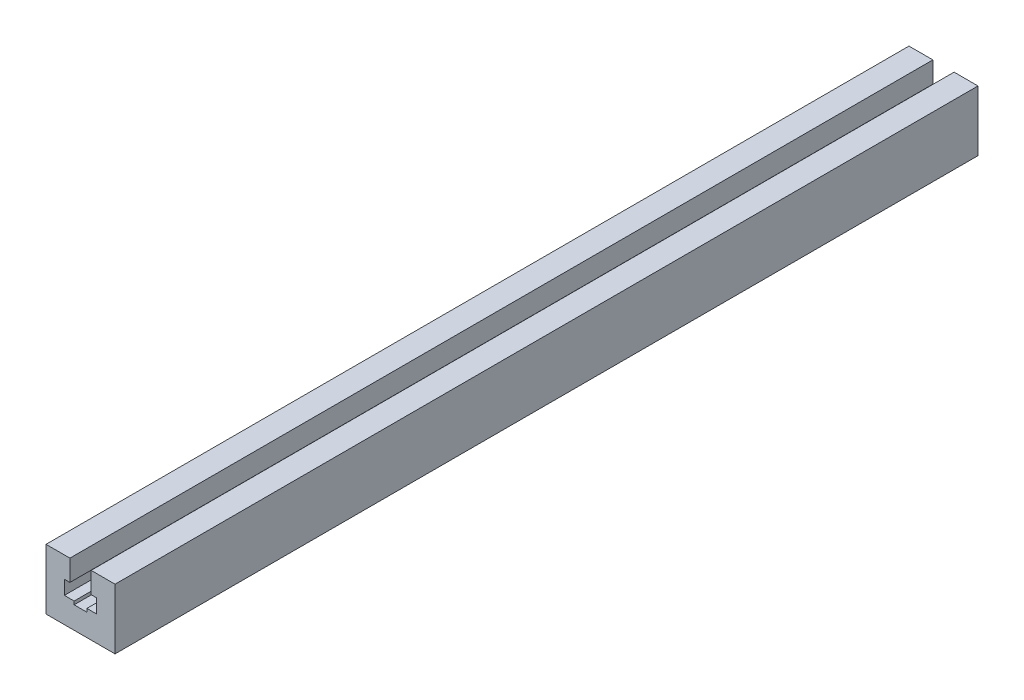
ISO-10303-21;
HEADER;
FILE_DESCRIPTION(('STEP AP214'),'2;1');
FILE_NAME('part.step','',(''),(''),'','','');
FILE_SCHEMA(('AUTOMOTIVE_DESIGN { 1 0 10303 214 1 1 1 1 }'));
ENDSEC;
DATA;
#1=APPLICATION_CONTEXT('core data for automotive mechanical design processes');
#2=APPLICATION_PROTOCOL_DEFINITION('international standard','automotive_design',2000,#1);
#3=PRODUCT_CONTEXT('',#1,'mechanical');
#4=PRODUCT('Part','Part','',(#3));
#5=PRODUCT_RELATED_PRODUCT_CATEGORY('part','',(#4));
#6=PRODUCT_DEFINITION_FORMATION('','',#4);
#7=PRODUCT_DEFINITION_CONTEXT('part definition',#1,'design');
#8=PRODUCT_DEFINITION('design','',#6,#7);
#9=PRODUCT_DEFINITION_SHAPE('','',#8);
#10=(LENGTH_UNIT() NAMED_UNIT(*) SI_UNIT(.MILLI.,.METRE.));
#11=(NAMED_UNIT(*) PLANE_ANGLE_UNIT() SI_UNIT($,.RADIAN.));
#12=(NAMED_UNIT(*) SI_UNIT($,.STERADIAN.) SOLID_ANGLE_UNIT());
#13=UNCERTAINTY_MEASURE_WITH_UNIT(LENGTH_MEASURE(1.E-05),#10,'distance_accuracy_value','');
#14=(GEOMETRIC_REPRESENTATION_CONTEXT(3) GLOBAL_UNCERTAINTY_ASSIGNED_CONTEXT((#13)) GLOBAL_UNIT_ASSIGNED_CONTEXT((#10,
#11,#12)) REPRESENTATION_CONTEXT('',''));
#15=CARTESIAN_POINT('',(0.,0.,0.));
#16=DIRECTION('',(0.,0.,1.));
#17=DIRECTION('',(1.,0.,0.));
#18=AXIS2_PLACEMENT_3D('',#15,#16,#17);
#19=CARTESIAN_POINT('',(-9.35000000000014,14.7,0.));
#20=DIRECTION('',(0.,-1.,0.));
#21=DIRECTION('',(0.,0.,-1.));
#22=AXIS2_PLACEMENT_3D('',#19,#20,#21);
#23=PLANE('',#22);
#24=DIRECTION('',(1.,0.,0.));
#25=VECTOR('',#24,1.);
#26=CARTESIAN_POINT('',(-9.35000000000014,14.7,500.));
#27=LINE('',#26,#25);
#28=CARTESIAN_POINT('',(-9.35000000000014,14.7,500.));
#29=VERTEX_POINT('',#28);
#30=CARTESIAN_POINT('',(-3.7,14.7,500.));
#31=VERTEX_POINT('',#30);
#32=EDGE_CURVE('E183',#29,#31,#27,.T.);
#33=ORIENTED_EDGE('',*,*,#32,.T.);
#34=DIRECTION('',(0.,0.,1.));
#35=VECTOR('',#34,1.);
#36=CARTESIAN_POINT('',(-3.7,14.7,0.));
#37=LINE('',#36,#35);
#38=CARTESIAN_POINT('',(-3.7,14.7,0.));
#39=VERTEX_POINT('',#38);
#40=EDGE_CURVE('E155',#39,#31,#37,.T.);
#41=ORIENTED_EDGE('',*,*,#40,.F.);
#42=DIRECTION('',(1.,0.,0.));
#43=VECTOR('',#42,1.);
#44=CARTESIAN_POINT('',(-9.35000000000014,14.7,0.));
#45=LINE('',#44,#43);
#46=CARTESIAN_POINT('',(-9.35000000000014,14.7,0.));
#47=VERTEX_POINT('',#46);
#48=EDGE_CURVE('E146',#47,#39,#45,.T.);
#49=ORIENTED_EDGE('',*,*,#48,.F.);
#50=DIRECTION('',(0.,0.,1.));
#51=VECTOR('',#50,1.);
#52=CARTESIAN_POINT('',(-9.35000000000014,14.7,0.));
#53=LINE('',#52,#51);
#54=EDGE_CURVE('E246',#47,#29,#53,.T.);
#55=ORIENTED_EDGE('',*,*,#54,.T.);
#56=EDGE_LOOP('',(#33,#41,#49,#55));
#57=FACE_BOUND('',#56,.T.);
#58=ADVANCED_FACE('F14',(#57),#23,.F.);
#59=CARTESIAN_POINT('',(-20.,35.,0.));
#60=DIRECTION('',(-1.,0.,0.));
#61=DIRECTION('',(0.,0.,1.));
#62=AXIS2_PLACEMENT_3D('',#59,#60,#61);
#63=PLANE('',#62);
#64=DIRECTION('',(0.,0.,1.));
#65=VECTOR('',#64,1.);
#66=CARTESIAN_POINT('',(-20.,35.,0.));
#67=LINE('',#66,#65);
#68=CARTESIAN_POINT('',(-20.,35.,0.));
#69=VERTEX_POINT('',#68);
#70=CARTESIAN_POINT('',(-20.,35.,500.));
#71=VERTEX_POINT('',#70);
#72=EDGE_CURVE('E9',#69,#71,#67,.T.);
#73=ORIENTED_EDGE('',*,*,#72,.F.);
#74=DIRECTION('',(0.,-1.,0.));
#75=VECTOR('',#74,1.);
#76=CARTESIAN_POINT('',(-20.,35.,0.));
#77=LINE('',#76,#75);
#78=CARTESIAN_POINT('',(-20.,0.,0.));
#79=VERTEX_POINT('',#78);
#80=EDGE_CURVE('E198',#69,#79,#77,.T.);
#81=ORIENTED_EDGE('',*,*,#80,.T.);
#82=DIRECTION('',(0.,0.,1.));
#83=VECTOR('',#82,1.);
#84=CARTESIAN_POINT('',(-20.,0.,0.));
#85=LINE('',#84,#83);
#86=CARTESIAN_POINT('',(-20.,0.,500.));
#87=VERTEX_POINT('',#86);
#88=EDGE_CURVE('E231',#79,#87,#85,.T.);
#89=ORIENTED_EDGE('',*,*,#88,.T.);
#90=DIRECTION('',(0.,-1.,0.));
#91=VECTOR('',#90,1.);
#92=CARTESIAN_POINT('',(-20.,35.,500.));
#93=LINE('',#92,#91);
#94=EDGE_CURVE('E157',#71,#87,#93,.T.);
#95=ORIENTED_EDGE('',*,*,#94,.F.);
#96=EDGE_LOOP('',(#73,#81,#89,#95));
#97=FACE_BOUND('',#96,.T.);
#98=ADVANCED_FACE('F262',(#97),#63,.T.);
#99=CARTESIAN_POINT('',(-20.,35.,0.));
#100=DIRECTION('',(0.,-1.,0.));
#101=DIRECTION('',(1.,0.,0.));
#102=AXIS2_PLACEMENT_3D('',#99,#100,#101);
#103=PLANE('',#102);
#104=DIRECTION('',(0.,0.,1.));
#105=VECTOR('',#104,1.);
#106=CARTESIAN_POINT('',(-6.15,35.,0.));
#107=LINE('',#106,#105);
#108=CARTESIAN_POINT('',(-6.15,35.,0.));
#109=VERTEX_POINT('',#108);
#110=CARTESIAN_POINT('',(-6.15,35.,500.));
#111=VERTEX_POINT('',#110);
#112=EDGE_CURVE('E22',#109,#111,#107,.T.);
#113=ORIENTED_EDGE('',*,*,#112,.F.);
#114=DIRECTION('',(1.,0.,0.));
#115=VECTOR('',#114,1.);
#116=CARTESIAN_POINT('',(-20.,35.,0.));
#117=LINE('',#116,#115);
#118=EDGE_CURVE('E228',#69,#109,#117,.T.);
#119=ORIENTED_EDGE('',*,*,#118,.F.);
#120=ORIENTED_EDGE('',*,*,#72,.T.);
#121=DIRECTION('',(1.,0.,0.));
#122=VECTOR('',#121,1.);
#123=CARTESIAN_POINT('',(-20.,35.,500.));
#124=LINE('',#123,#122);
#125=EDGE_CURVE('E195',#71,#111,#124,.T.);
#126=ORIENTED_EDGE('',*,*,#125,.T.);
#127=EDGE_LOOP('',(#113,#119,#120,#126));
#128=FACE_BOUND('',#127,.T.);
#129=ADVANCED_FACE('F16',(#128),#103,.F.);
#130=CARTESIAN_POINT('',(-6.15,22.8,0.));
#131=DIRECTION('',(1.,0.,0.));
#132=DIRECTION('',(0.,0.,-1.));
#133=AXIS2_PLACEMENT_3D('',#130,#131,#132);
#134=PLANE('',#133);
#135=DIRECTION('',(0.,0.,1.));
#136=VECTOR('',#135,1.);
#137=CARTESIAN_POINT('',(-6.15,22.8,0.));
#138=LINE('',#137,#136);
#139=CARTESIAN_POINT('',(-6.15,22.8,0.));
#140=VERTEX_POINT('',#139);
#141=CARTESIAN_POINT('',(-6.15,22.8,500.));
#142=VERTEX_POINT('',#141);
#143=EDGE_CURVE('E250',#140,#142,#138,.T.);
#144=ORIENTED_EDGE('',*,*,#143,.F.);
#145=DIRECTION('',(0.,1.,0.));
#146=VECTOR('',#145,1.);
#147=CARTESIAN_POINT('',(-6.15,22.8,0.));
#148=LINE('',#147,#146);
#149=EDGE_CURVE('E225',#140,#109,#148,.T.);
#150=ORIENTED_EDGE('',*,*,#149,.T.);
#151=ORIENTED_EDGE('',*,*,#112,.T.);
#152=DIRECTION('',(0.,1.,0.));
#153=VECTOR('',#152,1.);
#154=CARTESIAN_POINT('',(-6.15,22.8,500.));
#155=LINE('',#154,#153);
#156=EDGE_CURVE('E192',#142,#111,#155,.T.);
#157=ORIENTED_EDGE('',*,*,#156,.F.);
#158=EDGE_LOOP('',(#144,#150,#151,#157));
#159=FACE_BOUND('',#158,.T.);
#160=ADVANCED_FACE('F253',(#159),#134,.T.);
#161=CARTESIAN_POINT('',(-9.35,22.8,0.));
#162=DIRECTION('',(0.,-1.,0.));
#163=DIRECTION('',(0.,0.,-1.));
#164=AXIS2_PLACEMENT_3D('',#161,#162,#163);
#165=PLANE('',#164);
#166=DIRECTION('',(0.,0.,1.));
#167=VECTOR('',#166,1.);
#168=CARTESIAN_POINT('',(-9.35,22.8,0.));
#169=LINE('',#168,#167);
#170=CARTESIAN_POINT('',(-9.35,22.8,0.));
#171=VERTEX_POINT('',#170);
#172=CARTESIAN_POINT('',(-9.35,22.8,500.));
#173=VERTEX_POINT('',#172);
#174=EDGE_CURVE('E248',#171,#173,#169,.T.);
#175=ORIENTED_EDGE('',*,*,#174,.F.);
#176=DIRECTION('',(1.,0.,0.));
#177=VECTOR('',#176,1.);
#178=CARTESIAN_POINT('',(-9.35,22.8,0.));
#179=LINE('',#178,#177);
#180=EDGE_CURVE('E222',#171,#140,#179,.T.);
#181=ORIENTED_EDGE('',*,*,#180,.T.);
#182=ORIENTED_EDGE('',*,*,#143,.T.);
#183=DIRECTION('',(1.,0.,0.));
#184=VECTOR('',#183,1.);
#185=CARTESIAN_POINT('',(-9.35,22.8,500.));
#186=LINE('',#185,#184);
#187=EDGE_CURVE('E189',#173,#142,#186,.T.);
#188=ORIENTED_EDGE('',*,*,#187,.F.);
#189=EDGE_LOOP('',(#175,#181,#182,#188));
#190=FACE_BOUND('',#189,.T.);
#191=ADVANCED_FACE('F298',(#190),#165,.T.);
#192=CARTESIAN_POINT('',(-9.35,22.8,0.));
#193=DIRECTION('',(-1.,0.,0.));
#194=DIRECTION('',(0.,-1.,0.));
#195=AXIS2_PLACEMENT_3D('',#192,#193,#194);
#196=PLANE('',#195);
#197=ORIENTED_EDGE('',*,*,#54,.F.);
#198=DIRECTION('',(0.,-1.,0.));
#199=VECTOR('',#198,1.);
#200=CARTESIAN_POINT('',(-9.35,22.8,0.));
#201=LINE('',#200,#199);
#202=EDGE_CURVE('E220',#171,#47,#201,.T.);
#203=ORIENTED_EDGE('',*,*,#202,.F.);
#204=ORIENTED_EDGE('',*,*,#174,.T.);
#205=DIRECTION('',(0.,-1.,0.));
#206=VECTOR('',#205,1.);
#207=CARTESIAN_POINT('',(-9.35,22.8,500.));
#208=LINE('',#207,#206);
#209=EDGE_CURVE('E186',#173,#29,#208,.T.);
#210=ORIENTED_EDGE('',*,*,#209,.T.);
#211=EDGE_LOOP('',(#197,#203,#204,#210));
#212=FACE_BOUND('',#211,.T.);
#213=ADVANCED_FACE('F300',(#212),#196,.F.);
#214=CARTESIAN_POINT('',(3.7,14.7,0.));
#215=VERTEX_POINT('',#214);
#216=CARTESIAN_POINT('',(9.35,14.7,0.));
#217=VERTEX_POINT('',#216);
#218=EDGE_CURVE('E218',#215,#217,#45,.T.);
#219=ORIENTED_EDGE('',*,*,#218,.F.);
#220=DIRECTION('',(0.,0.,1.));
#221=VECTOR('',#220,1.);
#222=CARTESIAN_POINT('',(3.7,14.7,0.));
#223=LINE('',#222,#221);
#224=CARTESIAN_POINT('',(3.7,14.7,500.));
#225=VERTEX_POINT('',#224);
#226=EDGE_CURVE('E158',#215,#225,#223,.T.);
#227=ORIENTED_EDGE('',*,*,#226,.T.);
#228=CARTESIAN_POINT('',(9.35,14.7,500.));
#229=VERTEX_POINT('',#228);
#230=EDGE_CURVE('E182',#225,#229,#27,.T.);
#231=ORIENTED_EDGE('',*,*,#230,.T.);
#232=DIRECTION('',(0.,0.,1.));
#233=VECTOR('',#232,1.);
#234=CARTESIAN_POINT('',(9.35,14.7,0.));
#235=LINE('',#234,#233);
#236=EDGE_CURVE('E243',#217,#229,#235,.T.);
#237=ORIENTED_EDGE('',*,*,#236,.F.);
#238=EDGE_LOOP('',(#219,#227,#231,#237));
#239=FACE_BOUND('',#238,.T.);
#240=ADVANCED_FACE('F292',(#239),#23,.F.);
#241=CARTESIAN_POINT('',(9.35,22.8,0.));
#242=DIRECTION('',(-1.,0.,0.));
#243=DIRECTION('',(0.,0.,1.));
#244=AXIS2_PLACEMENT_3D('',#241,#242,#243);
#245=PLANE('',#244);
#246=DIRECTION('',(0.,0.,1.));
#247=VECTOR('',#246,1.);
#248=CARTESIAN_POINT('',(9.35,22.8,0.));
#249=LINE('',#248,#247);
#250=CARTESIAN_POINT('',(9.35,22.8,0.));
#251=VERTEX_POINT('',#250);
#252=CARTESIAN_POINT('',(9.35,22.8,500.));
#253=VERTEX_POINT('',#252);
#254=EDGE_CURVE('E241',#251,#253,#249,.T.);
#255=ORIENTED_EDGE('',*,*,#254,.F.);
#256=DIRECTION('',(0.,-1.,0.));
#257=VECTOR('',#256,1.);
#258=CARTESIAN_POINT('',(9.35,22.8,0.));
#259=LINE('',#258,#257);
#260=EDGE_CURVE('E215',#251,#217,#259,.T.);
#261=ORIENTED_EDGE('',*,*,#260,.T.);
#262=ORIENTED_EDGE('',*,*,#236,.T.);
#263=DIRECTION('',(0.,-1.,0.));
#264=VECTOR('',#263,1.);
#265=CARTESIAN_POINT('',(9.35,22.8,500.));
#266=LINE('',#265,#264);
#267=EDGE_CURVE('E179',#253,#229,#266,.T.);
#268=ORIENTED_EDGE('',*,*,#267,.F.);
#269=EDGE_LOOP('',(#255,#261,#262,#268));
#270=FACE_BOUND('',#269,.T.);
#271=ADVANCED_FACE('F286',(#270),#245,.T.);
#272=CARTESIAN_POINT('',(6.15,22.8,0.));
#273=DIRECTION('',(0.,-1.,0.));
#274=DIRECTION('',(0.,0.,-1.));
#275=AXIS2_PLACEMENT_3D('',#272,#273,#274);
#276=PLANE('',#275);
#277=DIRECTION('',(0.,0.,1.));
#278=VECTOR('',#277,1.);
#279=CARTESIAN_POINT('',(6.15,22.8,0.));
#280=LINE('',#279,#278);
#281=CARTESIAN_POINT('',(6.15,22.8,0.));
#282=VERTEX_POINT('',#281);
#283=CARTESIAN_POINT('',(6.15,22.8,500.));
#284=VERTEX_POINT('',#283);
#285=EDGE_CURVE('E239',#282,#284,#280,.T.);
#286=ORIENTED_EDGE('',*,*,#285,.F.);
#287=DIRECTION('',(1.,0.,0.));
#288=VECTOR('',#287,1.);
#289=CARTESIAN_POINT('',(6.15,22.8,0.));
#290=LINE('',#289,#288);
#291=EDGE_CURVE('E212',#282,#251,#290,.T.);
#292=ORIENTED_EDGE('',*,*,#291,.T.);
#293=ORIENTED_EDGE('',*,*,#254,.T.);
#294=DIRECTION('',(1.,0.,0.));
#295=VECTOR('',#294,1.);
#296=CARTESIAN_POINT('',(6.15,22.8,500.));
#297=LINE('',#296,#295);
#298=EDGE_CURVE('E176',#284,#253,#297,.T.);
#299=ORIENTED_EDGE('',*,*,#298,.F.);
#300=EDGE_LOOP('',(#286,#292,#293,#299));
#301=FACE_BOUND('',#300,.T.);
#302=ADVANCED_FACE('F283',(#301),#276,.T.);
#303=CARTESIAN_POINT('',(6.15,22.8,0.));
#304=DIRECTION('',(1.,0.,0.));
#305=DIRECTION('',(0.,0.,-1.));
#306=AXIS2_PLACEMENT_3D('',#303,#304,#305);
#307=PLANE('',#306);
#308=DIRECTION('',(0.,0.,1.));
#309=VECTOR('',#308,1.);
#310=CARTESIAN_POINT('',(6.15,35.,0.));
#311=LINE('',#310,#309);
#312=CARTESIAN_POINT('',(6.15,35.,0.));
#313=VERTEX_POINT('',#312);
#314=CARTESIAN_POINT('',(6.15,35.,500.));
#315=VERTEX_POINT('',#314);
#316=EDGE_CURVE('E237',#313,#315,#311,.T.);
#317=ORIENTED_EDGE('',*,*,#316,.F.);
#318=DIRECTION('',(0.,1.,0.));
#319=VECTOR('',#318,1.);
#320=CARTESIAN_POINT('',(6.15,22.8,0.));
#321=LINE('',#320,#319);
#322=EDGE_CURVE('E209',#282,#313,#321,.T.);
#323=ORIENTED_EDGE('',*,*,#322,.F.);
#324=ORIENTED_EDGE('',*,*,#285,.T.);
#325=DIRECTION('',(0.,1.,0.));
#326=VECTOR('',#325,1.);
#327=CARTESIAN_POINT('',(6.15,22.8,500.));
#328=LINE('',#327,#326);
#329=EDGE_CURVE('E173',#284,#315,#328,.T.);
#330=ORIENTED_EDGE('',*,*,#329,.T.);
#331=EDGE_LOOP('',(#317,#323,#324,#330));
#332=FACE_BOUND('',#331,.T.);
#333=ADVANCED_FACE('F278',(#332),#307,.F.);
#334=CARTESIAN_POINT('',(6.15,35.,0.));
#335=DIRECTION('',(0.,-1.,0.));
#336=DIRECTION('',(1.,0.,0.));
#337=AXIS2_PLACEMENT_3D('',#334,#335,#336);
#338=PLANE('',#337);
#339=DIRECTION('',(0.,0.,1.));
#340=VECTOR('',#339,1.);
#341=CARTESIAN_POINT('',(20.,35.,0.));
#342=LINE('',#341,#340);
#343=CARTESIAN_POINT('',(20.,35.,0.));
#344=VERTEX_POINT('',#343);
#345=CARTESIAN_POINT('',(20.,35.,500.));
#346=VERTEX_POINT('',#345);
#347=EDGE_CURVE('E235',#344,#346,#342,.T.);
#348=ORIENTED_EDGE('',*,*,#347,.F.);
#349=DIRECTION('',(1.,0.,0.));
#350=VECTOR('',#349,1.);
#351=CARTESIAN_POINT('',(6.15,35.,0.));
#352=LINE('',#351,#350);
#353=EDGE_CURVE('E206',#313,#344,#352,.T.);
#354=ORIENTED_EDGE('',*,*,#353,.F.);
#355=ORIENTED_EDGE('',*,*,#316,.T.);
#356=DIRECTION('',(1.,0.,0.));
#357=VECTOR('',#356,1.);
#358=CARTESIAN_POINT('',(6.15,35.,500.));
#359=LINE('',#358,#357);
#360=EDGE_CURVE('E170',#315,#346,#359,.T.);
#361=ORIENTED_EDGE('',*,*,#360,.T.);
#362=EDGE_LOOP('',(#348,#354,#355,#361));
#363=FACE_BOUND('',#362,.T.);
#364=ADVANCED_FACE('F274',(#363),#338,.F.);
#365=CARTESIAN_POINT('',(20.,35.,0.));
#366=DIRECTION('',(-1.,0.,0.));
#367=DIRECTION('',(0.,0.,1.));
#368=AXIS2_PLACEMENT_3D('',#365,#366,#367);
#369=PLANE('',#368);
#370=DIRECTION('',(0.,0.,1.));
#371=VECTOR('',#370,1.);
#372=CARTESIAN_POINT('',(20.,0.,0.));
#373=LINE('',#372,#371);
#374=CARTESIAN_POINT('',(20.,0.,0.));
#375=VERTEX_POINT('',#374);
#376=CARTESIAN_POINT('',(20.,0.,500.));
#377=VERTEX_POINT('',#376);
#378=EDGE_CURVE('E233',#375,#377,#373,.T.);
#379=ORIENTED_EDGE('',*,*,#378,.F.);
#380=DIRECTION('',(0.,-1.,0.));
#381=VECTOR('',#380,1.);
#382=CARTESIAN_POINT('',(20.,35.,0.));
#383=LINE('',#382,#381);
#384=EDGE_CURVE('E203',#344,#375,#383,.T.);
#385=ORIENTED_EDGE('',*,*,#384,.F.);
#386=ORIENTED_EDGE('',*,*,#347,.T.);
#387=DIRECTION('',(0.,-1.,0.));
#388=VECTOR('',#387,1.);
#389=CARTESIAN_POINT('',(20.,35.,500.));
#390=LINE('',#389,#388);
#391=EDGE_CURVE('E167',#346,#377,#390,.T.);
#392=ORIENTED_EDGE('',*,*,#391,.T.);
#393=EDGE_LOOP('',(#379,#385,#386,#392));
#394=FACE_BOUND('',#393,.T.);
#395=ADVANCED_FACE('F270',(#394),#369,.F.);
#396=CARTESIAN_POINT('',(-20.,0.,0.));
#397=DIRECTION('',(0.,-1.,0.));
#398=DIRECTION('',(0.,0.,-1.));
#399=AXIS2_PLACEMENT_3D('',#396,#397,#398);
#400=PLANE('',#399);
#401=DIRECTION('',(1.,0.,0.));
#402=VECTOR('',#401,1.);
#403=CARTESIAN_POINT('',(-20.,0.,0.));
#404=LINE('',#403,#402);
#405=EDGE_CURVE('E200',#79,#375,#404,.T.);
#406=ORIENTED_EDGE('',*,*,#405,.T.);
#407=ORIENTED_EDGE('',*,*,#378,.T.);
#408=DIRECTION('',(1.,0.,0.));
#409=VECTOR('',#408,1.);
#410=CARTESIAN_POINT('',(-20.,0.,500.));
#411=LINE('',#410,#409);
#412=EDGE_CURVE('E164',#87,#377,#411,.T.);
#413=ORIENTED_EDGE('',*,*,#412,.F.);
#414=ORIENTED_EDGE('',*,*,#88,.F.);
#415=EDGE_LOOP('',(#406,#407,#413,#414));
#416=FACE_BOUND('',#415,.T.);
#417=ADVANCED_FACE('F266',(#416),#400,.T.);
#418=CARTESIAN_POINT('',(-20.,0.,0.));
#419=DIRECTION('',(0.,0.,1.));
#420=DIRECTION('',(1.,0.,0.));
#421=AXIS2_PLACEMENT_3D('',#418,#419,#420);
#422=PLANE('',#421);
#423=ORIENTED_EDGE('',*,*,#48,.T.);
#424=DIRECTION('',(0.,-1.,0.));
#425=VECTOR('',#424,1.);
#426=CARTESIAN_POINT('',(-3.7,14.7,0.));
#427=LINE('',#426,#425);
#428=CARTESIAN_POINT('',(-3.7,12.8,0.));
#429=VERTEX_POINT('',#428);
#430=EDGE_CURVE('E127',#39,#429,#427,.T.);
#431=ORIENTED_EDGE('',*,*,#430,.T.);
#432=DIRECTION('',(1.,0.,0.));
#433=VECTOR('',#432,1.);
#434=CARTESIAN_POINT('',(-3.7,12.8,0.));
#435=LINE('',#434,#433);
#436=CARTESIAN_POINT('',(3.7,12.8,0.));
#437=VERTEX_POINT('',#436);
#438=EDGE_CURVE('E136',#429,#437,#435,.T.);
#439=ORIENTED_EDGE('',*,*,#438,.T.);
#440=DIRECTION('',(0.,1.,0.));
#441=VECTOR('',#440,1.);
#442=CARTESIAN_POINT('',(3.7,14.7,0.));
#443=LINE('',#442,#441);
#444=EDGE_CURVE('E133',#437,#215,#443,.T.);
#445=ORIENTED_EDGE('',*,*,#444,.T.);
#446=ORIENTED_EDGE('',*,*,#218,.T.);
#447=ORIENTED_EDGE('',*,*,#260,.F.);
#448=ORIENTED_EDGE('',*,*,#291,.F.);
#449=ORIENTED_EDGE('',*,*,#322,.T.);
#450=ORIENTED_EDGE('',*,*,#353,.T.);
#451=ORIENTED_EDGE('',*,*,#384,.T.);
#452=ORIENTED_EDGE('',*,*,#405,.F.);
#453=ORIENTED_EDGE('',*,*,#80,.F.);
#454=ORIENTED_EDGE('',*,*,#118,.T.);
#455=ORIENTED_EDGE('',*,*,#149,.F.);
#456=ORIENTED_EDGE('',*,*,#180,.F.);
#457=ORIENTED_EDGE('',*,*,#202,.T.);
#458=EDGE_LOOP('',(#423,#431,#439,#445,#446,#447,#448,#449,#450,#451,#452,#453,#454,#455,#456,#457));
#459=FACE_BOUND('',#458,.T.);
#460=ADVANCED_FACE('F143',(#459),#422,.F.);
#461=CARTESIAN_POINT('',(-20.,0.,500.));
#462=DIRECTION('',(0.,0.,1.));
#463=DIRECTION('',(1.,0.,0.));
#464=AXIS2_PLACEMENT_3D('',#461,#462,#463);
#465=PLANE('',#464);
#466=DIRECTION('',(0.,-1.,0.));
#467=VECTOR('',#466,1.);
#468=CARTESIAN_POINT('',(-3.7,14.7,500.));
#469=LINE('',#468,#467);
#470=CARTESIAN_POINT('',(-3.7,12.8,500.));
#471=VERTEX_POINT('',#470);
#472=EDGE_CURVE('E29',#31,#471,#469,.T.);
#473=ORIENTED_EDGE('',*,*,#472,.F.);
#474=ORIENTED_EDGE('',*,*,#32,.F.);
#475=ORIENTED_EDGE('',*,*,#209,.F.);
#476=ORIENTED_EDGE('',*,*,#187,.T.);
#477=ORIENTED_EDGE('',*,*,#156,.T.);
#478=ORIENTED_EDGE('',*,*,#125,.F.);
#479=ORIENTED_EDGE('',*,*,#94,.T.);
#480=ORIENTED_EDGE('',*,*,#412,.T.);
#481=ORIENTED_EDGE('',*,*,#391,.F.);
#482=ORIENTED_EDGE('',*,*,#360,.F.);
#483=ORIENTED_EDGE('',*,*,#329,.F.);
#484=ORIENTED_EDGE('',*,*,#298,.T.);
#485=ORIENTED_EDGE('',*,*,#267,.T.);
#486=ORIENTED_EDGE('',*,*,#230,.F.);
#487=DIRECTION('',(0.,1.,0.));
#488=VECTOR('',#487,1.);
#489=CARTESIAN_POINT('',(3.7,14.7,500.));
#490=LINE('',#489,#488);
#491=CARTESIAN_POINT('',(3.7,12.8,500.));
#492=VERTEX_POINT('',#491);
#493=EDGE_CURVE('E147',#492,#225,#490,.T.);
#494=ORIENTED_EDGE('',*,*,#493,.F.);
#495=DIRECTION('',(1.,0.,0.));
#496=VECTOR('',#495,1.);
#497=CARTESIAN_POINT('',(-3.7,12.8,500.));
#498=LINE('',#497,#496);
#499=EDGE_CURVE('E149',#471,#492,#498,.T.);
#500=ORIENTED_EDGE('',*,*,#499,.F.);
#501=EDGE_LOOP('',(#473,#474,#475,#476,#477,#478,#479,#480,#481,#482,#483,#484,#485,#486,#494,#500));
#502=FACE_BOUND('',#501,.T.);
#503=ADVANCED_FACE('F259',(#502),#465,.T.);
#504=CARTESIAN_POINT('',(-3.7,14.7,0.));
#505=DIRECTION('',(-1.,0.,0.));
#506=DIRECTION('',(0.,0.,1.));
#507=AXIS2_PLACEMENT_3D('',#504,#505,#506);
#508=PLANE('',#507);
#509=ORIENTED_EDGE('',*,*,#472,.T.);
#510=DIRECTION('',(0.,0.,1.));
#511=VECTOR('',#510,1.);
#512=CARTESIAN_POINT('',(-3.7,12.8,0.));
#513=LINE('',#512,#511);
#514=EDGE_CURVE('E123',#429,#471,#513,.T.);
#515=ORIENTED_EDGE('',*,*,#514,.F.);
#516=ORIENTED_EDGE('',*,*,#430,.F.);
#517=ORIENTED_EDGE('',*,*,#40,.T.);
#518=EDGE_LOOP('',(#509,#515,#516,#517));
#519=FACE_BOUND('',#518,.T.);
#520=ADVANCED_FACE('F125',(#519),#508,.F.);
#521=CARTESIAN_POINT('',(3.7,14.7,0.));
#522=DIRECTION('',(1.,0.,0.));
#523=DIRECTION('',(0.,0.,-1.));
#524=AXIS2_PLACEMENT_3D('',#521,#522,#523);
#525=PLANE('',#524);
#526=ORIENTED_EDGE('',*,*,#493,.T.);
#527=ORIENTED_EDGE('',*,*,#226,.F.);
#528=ORIENTED_EDGE('',*,*,#444,.F.);
#529=DIRECTION('',(0.,0.,1.));
#530=VECTOR('',#529,1.);
#531=CARTESIAN_POINT('',(3.7,12.8,0.));
#532=LINE('',#531,#530);
#533=EDGE_CURVE('E132',#437,#492,#532,.T.);
#534=ORIENTED_EDGE('',*,*,#533,.T.);
#535=EDGE_LOOP('',(#526,#527,#528,#534));
#536=FACE_BOUND('',#535,.T.);
#537=ADVANCED_FACE('F294',(#536),#525,.F.);
#538=CARTESIAN_POINT('',(-3.7,12.8,0.));
#539=DIRECTION('',(0.,-1.,0.));
#540=DIRECTION('',(0.,0.,-1.));
#541=AXIS2_PLACEMENT_3D('',#538,#539,#540);
#542=PLANE('',#541);
#543=ORIENTED_EDGE('',*,*,#499,.T.);
#544=ORIENTED_EDGE('',*,*,#533,.F.);
#545=ORIENTED_EDGE('',*,*,#438,.F.);
#546=ORIENTED_EDGE('',*,*,#514,.T.);
#547=EDGE_LOOP('',(#543,#544,#545,#546));
#548=FACE_BOUND('',#547,.T.);
#549=ADVANCED_FACE('F137',(#548),#542,.F.);
#550=CLOSED_SHELL('',(#58,#98,#129,#160,#191,#213,#240,#271,#302,#333,#364,#395,#417,#460,#503,
#520,#537,#549));
#551=MANIFOLD_SOLID_BREP('B1',#550);
#552=ADVANCED_BREP_SHAPE_REPRESENTATION('',(#18,#551),#14);
#553=SHAPE_DEFINITION_REPRESENTATION(#9,#552);
ENDSEC;
END-ISO-10303-21;
